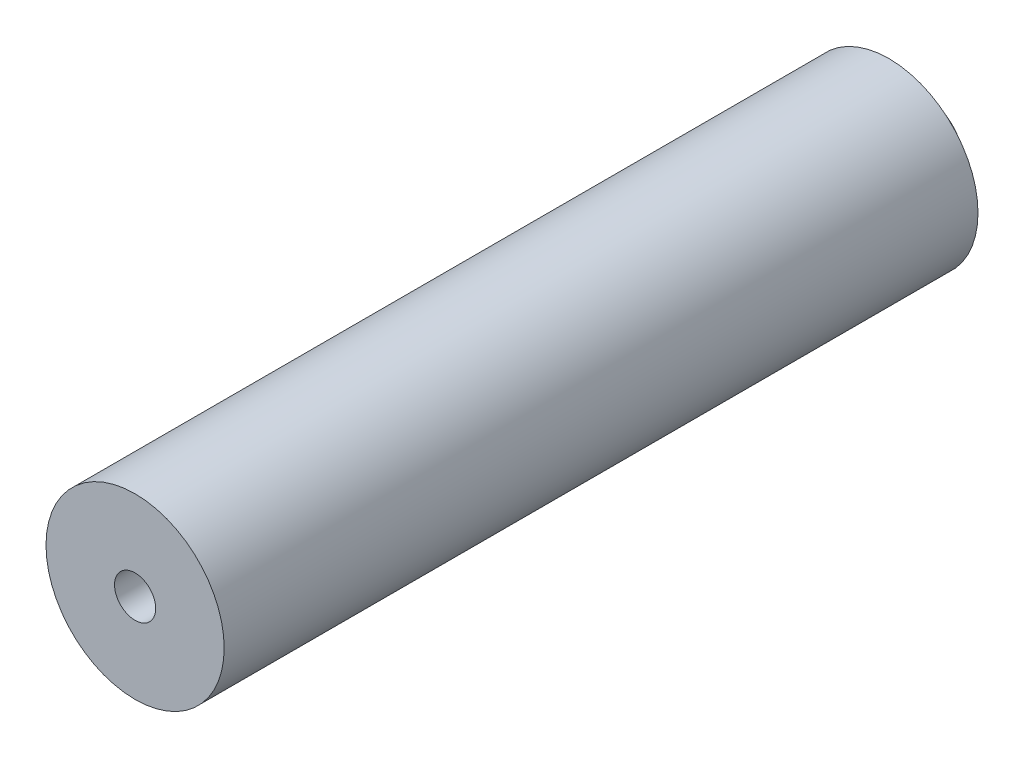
from build123d import *

# Parameters (mm, degrees)
ESQUISSE1_R             = 6.5
BOSS_EXTRU_1_DEPTH      = 55
ESQUISSE2_R             = 3
BOSS_EXTRU_2_DEPTH      = 2.5
ESQUISSE3_R             = 1.5
ENL_V_MAT_EXTRU_1_DEPTH = 59.230146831


with BuildPart() as part:
    # Esquisse1 → Boss.-Extru.1 (new body)
    with BuildSketch(Plane.XY):
        Circle(ESQUISSE1_R)
    extrude(amount=BOSS_EXTRU_1_DEPTH)

    # Esquisse2 → Boss.-Extru.2 (add)
    with BuildSketch(Plane(origin=(0, 0, 0), x_dir=(-1, 0, 0), z_dir=(0, 0, -1))):
        with Locations(Location((0, 0, 0), (0, 0, 180))):
            Circle(ESQUISSE2_R)
    extrude(amount=BOSS_EXTRU_2_DEPTH)

    # Esquisse3 → Enl_v. mat.-Extru.1 (cut, through all)
    with BuildSketch(Plane(origin=(0, 0, -2.5), x_dir=(-1, 0, 0), z_dir=(0, 0, -1))):
        Circle(ESQUISSE3_R)
    extrude(amount=-ENL_V_MAT_EXTRU_1_DEPTH, mode=Mode.SUBTRACT)


solid = part.part
